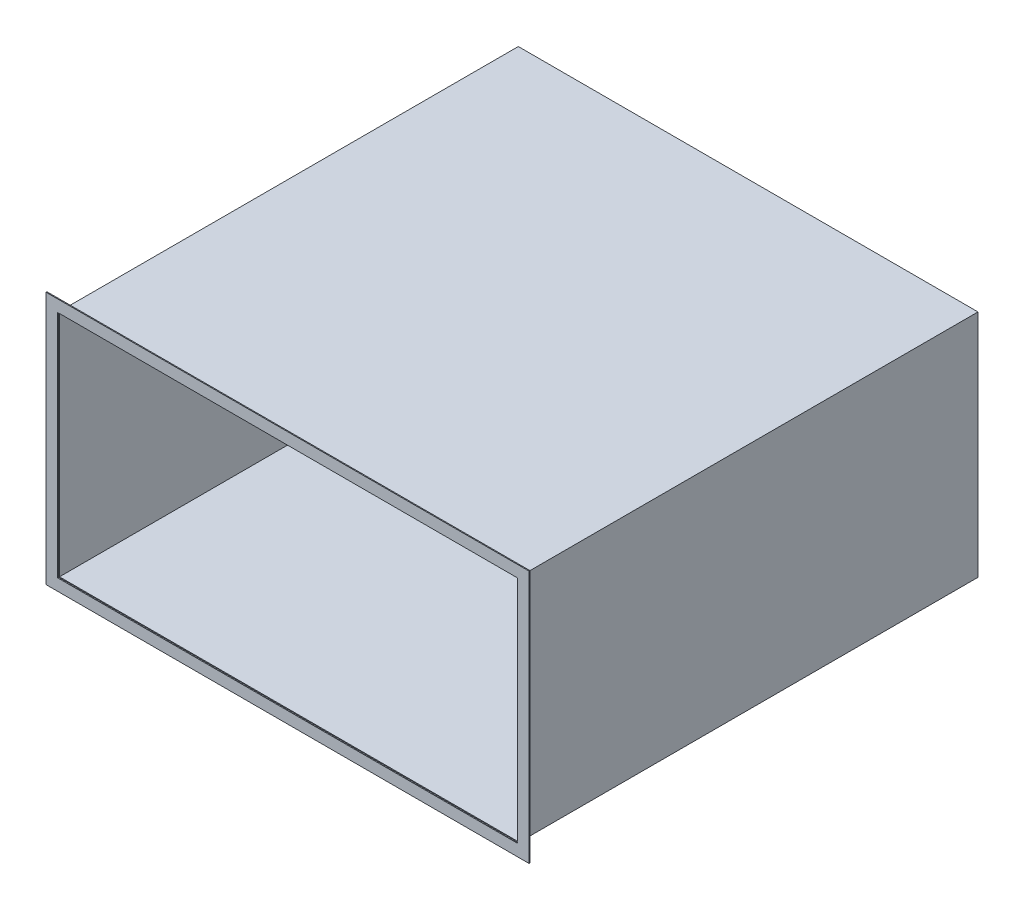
ISO-10303-21;
HEADER;
FILE_DESCRIPTION(('STEP AP214'),'2;1');
FILE_NAME('part.step','',(''),(''),'','','');
FILE_SCHEMA(('AUTOMOTIVE_DESIGN { 1 0 10303 214 1 1 1 1 }'));
ENDSEC;
DATA;
#1=APPLICATION_CONTEXT('core data for automotive mechanical design processes');
#2=APPLICATION_PROTOCOL_DEFINITION('international standard','automotive_design',2000,#1);
#3=PRODUCT_CONTEXT('',#1,'mechanical');
#4=PRODUCT('Part','Part','',(#3));
#5=PRODUCT_RELATED_PRODUCT_CATEGORY('part','',(#4));
#6=PRODUCT_DEFINITION_FORMATION('','',#4);
#7=PRODUCT_DEFINITION_CONTEXT('part definition',#1,'design');
#8=PRODUCT_DEFINITION('design','',#6,#7);
#9=PRODUCT_DEFINITION_SHAPE('','',#8);
#10=(LENGTH_UNIT() NAMED_UNIT(*) SI_UNIT(.MILLI.,.METRE.));
#11=(NAMED_UNIT(*) PLANE_ANGLE_UNIT() SI_UNIT($,.RADIAN.));
#12=(NAMED_UNIT(*) SI_UNIT($,.STERADIAN.) SOLID_ANGLE_UNIT());
#13=UNCERTAINTY_MEASURE_WITH_UNIT(LENGTH_MEASURE(1.E-05),#10,'distance_accuracy_value','');
#14=(GEOMETRIC_REPRESENTATION_CONTEXT(3) GLOBAL_UNCERTAINTY_ASSIGNED_CONTEXT((#13)) GLOBAL_UNIT_ASSIGNED_CONTEXT((#10,
#11,#12)) REPRESENTATION_CONTEXT('',''));
#15=CARTESIAN_POINT('',(0.,0.,0.));
#16=DIRECTION('',(0.,0.,1.));
#17=DIRECTION('',(1.,0.,0.));
#18=AXIS2_PLACEMENT_3D('',#15,#16,#17);
#19=CARTESIAN_POINT('',(0.,0.,1002.));
#20=DIRECTION('',(0.,0.,1.));
#21=DIRECTION('',(1.,0.,0.));
#22=AXIS2_PLACEMENT_3D('',#19,#20,#21);
#23=PLANE('',#22);
#24=DIRECTION('',(1.,0.,0.));
#25=VECTOR('',#24,1.);
#26=CARTESIAN_POINT('',(-525.4,-275.4,1002.));
#27=LINE('',#26,#25);
#28=CARTESIAN_POINT('',(-525.4,-275.4,1002.));
#29=VERTEX_POINT('',#28);
#30=CARTESIAN_POINT('',(525.4,-275.4,1002.));
#31=VERTEX_POINT('',#30);
#32=EDGE_CURVE('E167',#29,#31,#27,.T.);
#33=ORIENTED_EDGE('',*,*,#32,.T.);
#34=DIRECTION('',(0.,1.,0.));
#35=VECTOR('',#34,1.);
#36=CARTESIAN_POINT('',(525.4,-275.4,1002.));
#37=LINE('',#36,#35);
#38=CARTESIAN_POINT('',(525.4,275.4,1002.));
#39=VERTEX_POINT('',#38);
#40=EDGE_CURVE('E170',#31,#39,#37,.T.);
#41=ORIENTED_EDGE('',*,*,#40,.T.);
#42=DIRECTION('',(-1.,0.,0.));
#43=VECTOR('',#42,1.);
#44=CARTESIAN_POINT('',(525.4,275.4,1002.));
#45=LINE('',#44,#43);
#46=CARTESIAN_POINT('',(-525.4,275.4,1002.));
#47=VERTEX_POINT('',#46);
#48=EDGE_CURVE('E173',#39,#47,#45,.T.);
#49=ORIENTED_EDGE('',*,*,#48,.T.);
#50=DIRECTION('',(0.,-1.,0.));
#51=VECTOR('',#50,1.);
#52=CARTESIAN_POINT('',(-525.4,275.4,1002.));
#53=LINE('',#52,#51);
#54=EDGE_CURVE('E175',#47,#29,#53,.T.);
#55=ORIENTED_EDGE('',*,*,#54,.T.);
#56=EDGE_LOOP('',(#33,#41,#49,#55));
#57=FACE_BOUND('',#56,.T.);
#58=DIRECTION('',(0.,1.,0.));
#59=VECTOR('',#58,1.);
#60=CARTESIAN_POINT('',(500.,-250.,1002.));
#61=LINE('',#60,#59);
#62=CARTESIAN_POINT('',(500.,-250.,1002.));
#63=VERTEX_POINT('',#62);
#64=CARTESIAN_POINT('',(500.,250.,1002.));
#65=VERTEX_POINT('',#64);
#66=EDGE_CURVE('E139',#63,#65,#61,.T.);
#67=ORIENTED_EDGE('',*,*,#66,.F.);
#68=DIRECTION('',(1.,0.,0.));
#69=VECTOR('',#68,1.);
#70=CARTESIAN_POINT('',(-500.,-250.,1002.));
#71=LINE('',#70,#69);
#72=CARTESIAN_POINT('',(-500.,-250.,1002.));
#73=VERTEX_POINT('',#72);
#74=EDGE_CURVE('E131',#73,#63,#71,.T.);
#75=ORIENTED_EDGE('',*,*,#74,.F.);
#76=DIRECTION('',(0.,-1.,0.));
#77=VECTOR('',#76,1.);
#78=CARTESIAN_POINT('',(-500.,250.,1002.));
#79=LINE('',#78,#77);
#80=CARTESIAN_POINT('',(-500.,250.,1002.));
#81=VERTEX_POINT('',#80);
#82=EDGE_CURVE('E153',#81,#73,#79,.T.);
#83=ORIENTED_EDGE('',*,*,#82,.F.);
#84=DIRECTION('',(-1.,0.,0.));
#85=VECTOR('',#84,1.);
#86=CARTESIAN_POINT('',(500.,250.,1002.));
#87=LINE('',#86,#85);
#88=EDGE_CURVE('E151',#65,#81,#87,.T.);
#89=ORIENTED_EDGE('',*,*,#88,.F.);
#90=EDGE_LOOP('',(#67,#75,#83,#89));
#91=FACE_BOUND('',#90,.T.);
#92=ADVANCED_FACE('F66',(#57,#91),#23,.T.);
#93=CARTESIAN_POINT('',(0.,0.,1000.));
#94=DIRECTION('',(0.,0.,1.));
#95=DIRECTION('',(1.,0.,0.));
#96=AXIS2_PLACEMENT_3D('',#93,#94,#95);
#97=PLANE('',#96);
#98=DIRECTION('',(1.,0.,0.));
#99=VECTOR('',#98,1.);
#100=CARTESIAN_POINT('',(-525.4,-275.4,1000.));
#101=LINE('',#100,#99);
#102=CARTESIAN_POINT('',(-525.4,-275.4,1000.));
#103=VERTEX_POINT('',#102);
#104=CARTESIAN_POINT('',(525.4,-275.4,1000.));
#105=VERTEX_POINT('',#104);
#106=EDGE_CURVE('E147',#103,#105,#101,.T.);
#107=ORIENTED_EDGE('',*,*,#106,.F.);
#108=DIRECTION('',(0.,-1.,0.));
#109=VECTOR('',#108,1.);
#110=CARTESIAN_POINT('',(-525.4,275.4,1000.));
#111=LINE('',#110,#109);
#112=CARTESIAN_POINT('',(-525.4,275.4,1000.));
#113=VERTEX_POINT('',#112);
#114=EDGE_CURVE('E171',#113,#103,#111,.T.);
#115=ORIENTED_EDGE('',*,*,#114,.F.);
#116=DIRECTION('',(-1.,0.,0.));
#117=VECTOR('',#116,1.);
#118=CARTESIAN_POINT('',(525.4,275.4,1000.));
#119=LINE('',#118,#117);
#120=CARTESIAN_POINT('',(525.4,275.4,1000.));
#121=VERTEX_POINT('',#120);
#122=EDGE_CURVE('E182',#121,#113,#119,.T.);
#123=ORIENTED_EDGE('',*,*,#122,.F.);
#124=DIRECTION('',(0.,1.,0.));
#125=VECTOR('',#124,1.);
#126=CARTESIAN_POINT('',(525.4,-275.4,1000.));
#127=LINE('',#126,#125);
#128=EDGE_CURVE('E180',#105,#121,#127,.T.);
#129=ORIENTED_EDGE('',*,*,#128,.F.);
#130=EDGE_LOOP('',(#107,#115,#123,#129));
#131=FACE_BOUND('',#130,.T.);
#132=DIRECTION('',(1.,0.,0.));
#133=VECTOR('',#132,1.);
#134=CARTESIAN_POINT('',(-500.,-250.,1000.));
#135=LINE('',#134,#133);
#136=CARTESIAN_POINT('',(-500.,-250.,1000.));
#137=VERTEX_POINT('',#136);
#138=CARTESIAN_POINT('',(500.,-250.,1000.));
#139=VERTEX_POINT('',#138);
#140=EDGE_CURVE('E89',#137,#139,#135,.T.);
#141=ORIENTED_EDGE('',*,*,#140,.T.);
#142=DIRECTION('',(0.,1.,0.));
#143=VECTOR('',#142,1.);
#144=CARTESIAN_POINT('',(500.,-250.,1000.));
#145=LINE('',#144,#143);
#146=CARTESIAN_POINT('',(500.,250.,1000.));
#147=VERTEX_POINT('',#146);
#148=EDGE_CURVE('E146',#139,#147,#145,.T.);
#149=ORIENTED_EDGE('',*,*,#148,.T.);
#150=DIRECTION('',(-1.,0.,0.));
#151=VECTOR('',#150,1.);
#152=CARTESIAN_POINT('',(500.,250.,1000.));
#153=LINE('',#152,#151);
#154=CARTESIAN_POINT('',(-500.,250.,1000.));
#155=VERTEX_POINT('',#154);
#156=EDGE_CURVE('E159',#147,#155,#153,.T.);
#157=ORIENTED_EDGE('',*,*,#156,.T.);
#158=DIRECTION('',(0.,-1.,0.));
#159=VECTOR('',#158,1.);
#160=CARTESIAN_POINT('',(-500.,250.,1000.));
#161=LINE('',#160,#159);
#162=EDGE_CURVE('E140',#155,#137,#161,.T.);
#163=ORIENTED_EDGE('',*,*,#162,.T.);
#164=EDGE_LOOP('',(#141,#149,#157,#163));
#165=FACE_BOUND('',#164,.T.);
#166=ADVANCED_FACE('F200',(#131,#165),#97,.F.);
#167=CARTESIAN_POINT('',(-525.4,-275.4,1002.));
#168=DIRECTION('',(0.,1.,0.));
#169=DIRECTION('',(0.,0.,1.));
#170=AXIS2_PLACEMENT_3D('',#167,#168,#169);
#171=PLANE('',#170);
#172=ORIENTED_EDGE('',*,*,#106,.T.);
#173=DIRECTION('',(0.,0.,-1.));
#174=VECTOR('',#173,1.);
#175=CARTESIAN_POINT('',(525.4,-275.4,1002.));
#176=LINE('',#175,#174);
#177=EDGE_CURVE('E13',#31,#105,#176,.T.);
#178=ORIENTED_EDGE('',*,*,#177,.F.);
#179=ORIENTED_EDGE('',*,*,#32,.F.);
#180=DIRECTION('',(0.,0.,-1.));
#181=VECTOR('',#180,1.);
#182=CARTESIAN_POINT('',(-525.4,-275.4,1002.));
#183=LINE('',#182,#181);
#184=EDGE_CURVE('E177',#29,#103,#183,.T.);
#185=ORIENTED_EDGE('',*,*,#184,.T.);
#186=EDGE_LOOP('',(#172,#178,#179,#185));
#187=FACE_BOUND('',#186,.T.);
#188=ADVANCED_FACE('F68',(#187),#171,.F.);
#189=CARTESIAN_POINT('',(525.4,-275.4,1002.));
#190=DIRECTION('',(-1.,0.,0.));
#191=DIRECTION('',(0.,-1.,0.));
#192=AXIS2_PLACEMENT_3D('',#189,#190,#191);
#193=PLANE('',#192);
#194=ORIENTED_EDGE('',*,*,#128,.T.);
#195=DIRECTION('',(0.,0.,-1.));
#196=VECTOR('',#195,1.);
#197=CARTESIAN_POINT('',(525.4,275.4,1002.));
#198=LINE('',#197,#196);
#199=EDGE_CURVE('E74',#39,#121,#198,.T.);
#200=ORIENTED_EDGE('',*,*,#199,.F.);
#201=ORIENTED_EDGE('',*,*,#40,.F.);
#202=ORIENTED_EDGE('',*,*,#177,.T.);
#203=EDGE_LOOP('',(#194,#200,#201,#202));
#204=FACE_BOUND('',#203,.T.);
#205=ADVANCED_FACE('F210',(#204),#193,.F.);
#206=CARTESIAN_POINT('',(525.4,275.4,1002.));
#207=DIRECTION('',(0.,-1.,0.));
#208=DIRECTION('',(0.,0.,-1.));
#209=AXIS2_PLACEMENT_3D('',#206,#207,#208);
#210=PLANE('',#209);
#211=ORIENTED_EDGE('',*,*,#122,.T.);
#212=DIRECTION('',(0.,0.,-1.));
#213=VECTOR('',#212,1.);
#214=CARTESIAN_POINT('',(-525.4,275.4,1002.));
#215=LINE('',#214,#213);
#216=EDGE_CURVE('E187',#47,#113,#215,.T.);
#217=ORIENTED_EDGE('',*,*,#216,.F.);
#218=ORIENTED_EDGE('',*,*,#48,.F.);
#219=ORIENTED_EDGE('',*,*,#199,.T.);
#220=EDGE_LOOP('',(#211,#217,#218,#219));
#221=FACE_BOUND('',#220,.T.);
#222=ADVANCED_FACE('F194',(#221),#210,.F.);
#223=CARTESIAN_POINT('',(-525.4,275.4,1002.));
#224=DIRECTION('',(1.,0.,0.));
#225=DIRECTION('',(0.,1.,0.));
#226=AXIS2_PLACEMENT_3D('',#223,#224,#225);
#227=PLANE('',#226);
#228=ORIENTED_EDGE('',*,*,#114,.T.);
#229=ORIENTED_EDGE('',*,*,#184,.F.);
#230=ORIENTED_EDGE('',*,*,#54,.F.);
#231=ORIENTED_EDGE('',*,*,#216,.T.);
#232=EDGE_LOOP('',(#228,#229,#230,#231));
#233=FACE_BOUND('',#232,.T.);
#234=ADVANCED_FACE('F204',(#233),#227,.F.);
#235=CARTESIAN_POINT('',(-500.,-250.,1002.));
#236=DIRECTION('',(0.,1.,0.));
#237=DIRECTION('',(0.,0.,1.));
#238=AXIS2_PLACEMENT_3D('',#235,#236,#237);
#239=PLANE('',#238);
#240=ORIENTED_EDGE('',*,*,#140,.F.);
#241=DIRECTION('',(0.,0.,-1.));
#242=VECTOR('',#241,1.);
#243=CARTESIAN_POINT('',(-500.,-250.,1002.));
#244=LINE('',#243,#242);
#245=EDGE_CURVE('E135',#73,#137,#244,.T.);
#246=ORIENTED_EDGE('',*,*,#245,.F.);
#247=ORIENTED_EDGE('',*,*,#74,.T.);
#248=DIRECTION('',(0.,0.,-1.));
#249=VECTOR('',#248,1.);
#250=CARTESIAN_POINT('',(500.,-250.,1002.));
#251=LINE('',#250,#249);
#252=EDGE_CURVE('E134',#63,#139,#251,.T.);
#253=ORIENTED_EDGE('',*,*,#252,.T.);
#254=EDGE_LOOP('',(#240,#246,#247,#253));
#255=FACE_BOUND('',#254,.T.);
#256=ADVANCED_FACE('F133',(#255),#239,.T.);
#257=CARTESIAN_POINT('',(500.,-250.,1002.));
#258=DIRECTION('',(-1.,0.,0.));
#259=DIRECTION('',(0.,-1.,0.));
#260=AXIS2_PLACEMENT_3D('',#257,#258,#259);
#261=PLANE('',#260);
#262=ORIENTED_EDGE('',*,*,#148,.F.);
#263=ORIENTED_EDGE('',*,*,#252,.F.);
#264=ORIENTED_EDGE('',*,*,#66,.T.);
#265=DIRECTION('',(0.,0.,-1.));
#266=VECTOR('',#265,1.);
#267=CARTESIAN_POINT('',(500.,250.,1002.));
#268=LINE('',#267,#266);
#269=EDGE_CURVE('E148',#65,#147,#268,.T.);
#270=ORIENTED_EDGE('',*,*,#269,.T.);
#271=EDGE_LOOP('',(#262,#263,#264,#270));
#272=FACE_BOUND('',#271,.T.);
#273=ADVANCED_FACE('F143',(#272),#261,.T.);
#274=CARTESIAN_POINT('',(500.,250.,1002.));
#275=DIRECTION('',(0.,-1.,0.));
#276=DIRECTION('',(0.,0.,-1.));
#277=AXIS2_PLACEMENT_3D('',#274,#275,#276);
#278=PLANE('',#277);
#279=ORIENTED_EDGE('',*,*,#156,.F.);
#280=ORIENTED_EDGE('',*,*,#269,.F.);
#281=ORIENTED_EDGE('',*,*,#88,.T.);
#282=DIRECTION('',(0.,0.,-1.));
#283=VECTOR('',#282,1.);
#284=CARTESIAN_POINT('',(-500.,250.,1002.));
#285=LINE('',#284,#283);
#286=EDGE_CURVE('E81',#81,#155,#285,.T.);
#287=ORIENTED_EDGE('',*,*,#286,.T.);
#288=EDGE_LOOP('',(#279,#280,#281,#287));
#289=FACE_BOUND('',#288,.T.);
#290=ADVANCED_FACE('F233',(#289),#278,.T.);
#291=CARTESIAN_POINT('',(-500.,250.,1002.));
#292=DIRECTION('',(1.,0.,0.));
#293=DIRECTION('',(0.,1.,0.));
#294=AXIS2_PLACEMENT_3D('',#291,#292,#293);
#295=PLANE('',#294);
#296=ORIENTED_EDGE('',*,*,#162,.F.);
#297=ORIENTED_EDGE('',*,*,#286,.F.);
#298=ORIENTED_EDGE('',*,*,#82,.T.);
#299=ORIENTED_EDGE('',*,*,#245,.T.);
#300=EDGE_LOOP('',(#296,#297,#298,#299));
#301=FACE_BOUND('',#300,.T.);
#302=ADVANCED_FACE('F237',(#301),#295,.T.);
#303=CLOSED_SHELL('',(#92,#166,#188,#205,#222,#234,#256,#273,#290,#302));
#304=MANIFOLD_SOLID_BREP('B2',#303);
#305=CARTESIAN_POINT('',(0.,0.,1000.));
#306=DIRECTION('',(0.,0.,1.));
#307=DIRECTION('',(1.,0.,0.));
#308=AXIS2_PLACEMENT_3D('',#305,#306,#307);
#309=PLANE('',#308);
#310=DIRECTION('',(0.,1.,0.));
#311=VECTOR('',#310,1.);
#312=CARTESIAN_POINT('',(500.,250.,1000.));
#313=LINE('',#312,#311);
#314=CARTESIAN_POINT('',(500.,-250.,1000.));
#315=VERTEX_POINT('',#314);
#316=CARTESIAN_POINT('',(500.,250.,1000.));
#317=VERTEX_POINT('',#316);
#318=EDGE_CURVE('E396',#315,#317,#313,.T.);
#319=ORIENTED_EDGE('',*,*,#318,.T.);
#320=DIRECTION('',(-1.,0.,0.));
#321=VECTOR('',#320,1.);
#322=CARTESIAN_POINT('',(-500.,250.,1000.));
#323=LINE('',#322,#321);
#324=CARTESIAN_POINT('',(-500.,250.,1000.));
#325=VERTEX_POINT('',#324);
#326=EDGE_CURVE('E399',#317,#325,#323,.T.);
#327=ORIENTED_EDGE('',*,*,#326,.T.);
#328=DIRECTION('',(0.,-1.,0.));
#329=VECTOR('',#328,1.);
#330=CARTESIAN_POINT('',(-500.,250.,1000.));
#331=LINE('',#330,#329);
#332=CARTESIAN_POINT('',(-500.,-250.,1000.));
#333=VERTEX_POINT('',#332);
#334=EDGE_CURVE('E402',#325,#333,#331,.T.);
#335=ORIENTED_EDGE('',*,*,#334,.T.);
#336=DIRECTION('',(1.,0.,0.));
#337=VECTOR('',#336,1.);
#338=CARTESIAN_POINT('',(-500.,-250.,1000.));
#339=LINE('',#338,#337);
#340=EDGE_CURVE('E404',#333,#315,#339,.T.);
#341=ORIENTED_EDGE('',*,*,#340,.T.);
#342=EDGE_LOOP('',(#319,#327,#335,#341));
#343=FACE_BOUND('',#342,.T.);
#344=DIRECTION('',(-1.,0.,0.));
#345=VECTOR('',#344,1.);
#346=CARTESIAN_POINT('',(-500.,248.,1000.));
#347=LINE('',#346,#345);
#348=CARTESIAN_POINT('',(498.,248.,1000.));
#349=VERTEX_POINT('',#348);
#350=CARTESIAN_POINT('',(-498.,248.,1000.));
#351=VERTEX_POINT('',#350);
#352=EDGE_CURVE('E368',#349,#351,#347,.T.);
#353=ORIENTED_EDGE('',*,*,#352,.F.);
#354=DIRECTION('',(0.,1.,0.));
#355=VECTOR('',#354,1.);
#356=CARTESIAN_POINT('',(498.,250.,1000.));
#357=LINE('',#356,#355);
#358=CARTESIAN_POINT('',(498.,-248.,1000.));
#359=VERTEX_POINT('',#358);
#360=EDGE_CURVE('E360',#359,#349,#357,.T.);
#361=ORIENTED_EDGE('',*,*,#360,.F.);
#362=DIRECTION('',(1.,0.,0.));
#363=VECTOR('',#362,1.);
#364=CARTESIAN_POINT('',(-500.,-248.,1000.));
#365=LINE('',#364,#363);
#366=CARTESIAN_POINT('',(-498.,-248.,1000.));
#367=VERTEX_POINT('',#366);
#368=EDGE_CURVE('E382',#367,#359,#365,.T.);
#369=ORIENTED_EDGE('',*,*,#368,.F.);
#370=DIRECTION('',(0.,-1.,0.));
#371=VECTOR('',#370,1.);
#372=CARTESIAN_POINT('',(-498.,250.,1000.));
#373=LINE('',#372,#371);
#374=EDGE_CURVE('E380',#351,#367,#373,.T.);
#375=ORIENTED_EDGE('',*,*,#374,.F.);
#376=EDGE_LOOP('',(#353,#361,#369,#375));
#377=FACE_BOUND('',#376,.T.);
#378=ADVANCED_FACE('F295',(#343,#377),#309,.T.);
#379=CARTESIAN_POINT('',(0.,0.,0.));
#380=DIRECTION('',(0.,0.,1.));
#381=DIRECTION('',(1.,0.,0.));
#382=AXIS2_PLACEMENT_3D('',#379,#380,#381);
#383=PLANE('',#382);
#384=DIRECTION('',(0.,1.,0.));
#385=VECTOR('',#384,1.);
#386=CARTESIAN_POINT('',(500.,250.,0.));
#387=LINE('',#386,#385);
#388=CARTESIAN_POINT('',(500.,-250.,0.));
#389=VERTEX_POINT('',#388);
#390=CARTESIAN_POINT('',(500.,250.,0.));
#391=VERTEX_POINT('',#390);
#392=EDGE_CURVE('E376',#389,#391,#387,.T.);
#393=ORIENTED_EDGE('',*,*,#392,.F.);
#394=DIRECTION('',(1.,0.,0.));
#395=VECTOR('',#394,1.);
#396=CARTESIAN_POINT('',(-500.,-250.,0.));
#397=LINE('',#396,#395);
#398=CARTESIAN_POINT('',(-500.,-250.,0.));
#399=VERTEX_POINT('',#398);
#400=EDGE_CURVE('E400',#399,#389,#397,.T.);
#401=ORIENTED_EDGE('',*,*,#400,.F.);
#402=DIRECTION('',(0.,-1.,0.));
#403=VECTOR('',#402,1.);
#404=CARTESIAN_POINT('',(-500.,250.,0.));
#405=LINE('',#404,#403);
#406=CARTESIAN_POINT('',(-500.,250.,0.));
#407=VERTEX_POINT('',#406);
#408=EDGE_CURVE('E411',#407,#399,#405,.T.);
#409=ORIENTED_EDGE('',*,*,#408,.F.);
#410=DIRECTION('',(-1.,0.,0.));
#411=VECTOR('',#410,1.);
#412=CARTESIAN_POINT('',(-500.,250.,0.));
#413=LINE('',#412,#411);
#414=EDGE_CURVE('E409',#391,#407,#413,.T.);
#415=ORIENTED_EDGE('',*,*,#414,.F.);
#416=EDGE_LOOP('',(#393,#401,#409,#415));
#417=FACE_BOUND('',#416,.T.);
#418=DIRECTION('',(0.,1.,0.));
#419=VECTOR('',#418,1.);
#420=CARTESIAN_POINT('',(498.,250.,0.));
#421=LINE('',#420,#419);
#422=CARTESIAN_POINT('',(498.,-248.,0.));
#423=VERTEX_POINT('',#422);
#424=CARTESIAN_POINT('',(498.,248.,0.));
#425=VERTEX_POINT('',#424);
#426=EDGE_CURVE('E318',#423,#425,#421,.T.);
#427=ORIENTED_EDGE('',*,*,#426,.T.);
#428=DIRECTION('',(-1.,0.,0.));
#429=VECTOR('',#428,1.);
#430=CARTESIAN_POINT('',(-500.,248.,0.));
#431=LINE('',#430,#429);
#432=CARTESIAN_POINT('',(-498.,248.,0.));
#433=VERTEX_POINT('',#432);
#434=EDGE_CURVE('E375',#425,#433,#431,.T.);
#435=ORIENTED_EDGE('',*,*,#434,.T.);
#436=DIRECTION('',(0.,-1.,0.));
#437=VECTOR('',#436,1.);
#438=CARTESIAN_POINT('',(-498.,250.,0.));
#439=LINE('',#438,#437);
#440=CARTESIAN_POINT('',(-498.,-248.,0.));
#441=VERTEX_POINT('',#440);
#442=EDGE_CURVE('E388',#433,#441,#439,.T.);
#443=ORIENTED_EDGE('',*,*,#442,.T.);
#444=DIRECTION('',(1.,0.,0.));
#445=VECTOR('',#444,1.);
#446=CARTESIAN_POINT('',(-500.,-248.,0.));
#447=LINE('',#446,#445);
#448=EDGE_CURVE('E369',#441,#423,#447,.T.);
#449=ORIENTED_EDGE('',*,*,#448,.T.);
#450=EDGE_LOOP('',(#427,#435,#443,#449));
#451=FACE_BOUND('',#450,.T.);
#452=ADVANCED_FACE('F429',(#417,#451),#383,.F.);
#453=CARTESIAN_POINT('',(500.,250.,1000.));
#454=DIRECTION('',(-1.,0.,0.));
#455=DIRECTION('',(0.,-1.,0.));
#456=AXIS2_PLACEMENT_3D('',#453,#454,#455);
#457=PLANE('',#456);
#458=ORIENTED_EDGE('',*,*,#392,.T.);
#459=DIRECTION('',(0.,0.,-1.));
#460=VECTOR('',#459,1.);
#461=CARTESIAN_POINT('',(500.,250.,1000.));
#462=LINE('',#461,#460);
#463=EDGE_CURVE('E64',#317,#391,#462,.T.);
#464=ORIENTED_EDGE('',*,*,#463,.F.);
#465=ORIENTED_EDGE('',*,*,#318,.F.);
#466=DIRECTION('',(0.,0.,-1.));
#467=VECTOR('',#466,1.);
#468=CARTESIAN_POINT('',(500.,-250.,1000.));
#469=LINE('',#468,#467);
#470=EDGE_CURVE('E406',#315,#389,#469,.T.);
#471=ORIENTED_EDGE('',*,*,#470,.T.);
#472=EDGE_LOOP('',(#458,#464,#465,#471));
#473=FACE_BOUND('',#472,.T.);
#474=ADVANCED_FACE('F297',(#473),#457,.F.);
#475=CARTESIAN_POINT('',(-500.,250.,1000.));
#476=DIRECTION('',(0.,-1.,0.));
#477=DIRECTION('',(0.,0.,-1.));
#478=AXIS2_PLACEMENT_3D('',#475,#476,#477);
#479=PLANE('',#478);
#480=ORIENTED_EDGE('',*,*,#414,.T.);
#481=DIRECTION('',(0.,0.,-1.));
#482=VECTOR('',#481,1.);
#483=CARTESIAN_POINT('',(-500.,250.,1000.));
#484=LINE('',#483,#482);
#485=EDGE_CURVE('E303',#325,#407,#484,.T.);
#486=ORIENTED_EDGE('',*,*,#485,.F.);
#487=ORIENTED_EDGE('',*,*,#326,.F.);
#488=ORIENTED_EDGE('',*,*,#463,.T.);
#489=EDGE_LOOP('',(#480,#486,#487,#488));
#490=FACE_BOUND('',#489,.T.);
#491=ADVANCED_FACE('F439',(#490),#479,.F.);
#492=CARTESIAN_POINT('',(-500.,250.,1000.));
#493=DIRECTION('',(1.,0.,0.));
#494=DIRECTION('',(0.,1.,0.));
#495=AXIS2_PLACEMENT_3D('',#492,#493,#494);
#496=PLANE('',#495);
#497=ORIENTED_EDGE('',*,*,#408,.T.);
#498=DIRECTION('',(0.,0.,-1.));
#499=VECTOR('',#498,1.);
#500=CARTESIAN_POINT('',(-500.,-250.,1000.));
#501=LINE('',#500,#499);
#502=EDGE_CURVE('E416',#333,#399,#501,.T.);
#503=ORIENTED_EDGE('',*,*,#502,.F.);
#504=ORIENTED_EDGE('',*,*,#334,.F.);
#505=ORIENTED_EDGE('',*,*,#485,.T.);
#506=EDGE_LOOP('',(#497,#503,#504,#505));
#507=FACE_BOUND('',#506,.T.);
#508=ADVANCED_FACE('F423',(#507),#496,.F.);
#509=CARTESIAN_POINT('',(-500.,-250.,1000.));
#510=DIRECTION('',(0.,1.,0.));
#511=DIRECTION('',(0.,0.,1.));
#512=AXIS2_PLACEMENT_3D('',#509,#510,#511);
#513=PLANE('',#512);
#514=ORIENTED_EDGE('',*,*,#400,.T.);
#515=ORIENTED_EDGE('',*,*,#470,.F.);
#516=ORIENTED_EDGE('',*,*,#340,.F.);
#517=ORIENTED_EDGE('',*,*,#502,.T.);
#518=EDGE_LOOP('',(#514,#515,#516,#517));
#519=FACE_BOUND('',#518,.T.);
#520=ADVANCED_FACE('F433',(#519),#513,.F.);
#521=CARTESIAN_POINT('',(498.,250.,1000.));
#522=DIRECTION('',(-1.,0.,0.));
#523=DIRECTION('',(0.,-1.,0.));
#524=AXIS2_PLACEMENT_3D('',#521,#522,#523);
#525=PLANE('',#524);
#526=ORIENTED_EDGE('',*,*,#426,.F.);
#527=DIRECTION('',(0.,0.,-1.));
#528=VECTOR('',#527,1.);
#529=CARTESIAN_POINT('',(498.,-248.,1000.));
#530=LINE('',#529,#528);
#531=EDGE_CURVE('E364',#359,#423,#530,.T.);
#532=ORIENTED_EDGE('',*,*,#531,.F.);
#533=ORIENTED_EDGE('',*,*,#360,.T.);
#534=DIRECTION('',(0.,0.,-1.));
#535=VECTOR('',#534,1.);
#536=CARTESIAN_POINT('',(498.,248.,1000.));
#537=LINE('',#536,#535);
#538=EDGE_CURVE('E363',#349,#425,#537,.T.);
#539=ORIENTED_EDGE('',*,*,#538,.T.);
#540=EDGE_LOOP('',(#526,#532,#533,#539));
#541=FACE_BOUND('',#540,.T.);
#542=ADVANCED_FACE('F362',(#541),#525,.T.);
#543=CARTESIAN_POINT('',(-500.,248.,1000.));
#544=DIRECTION('',(0.,-1.,0.));
#545=DIRECTION('',(0.,0.,-1.));
#546=AXIS2_PLACEMENT_3D('',#543,#544,#545);
#547=PLANE('',#546);
#548=ORIENTED_EDGE('',*,*,#434,.F.);
#549=ORIENTED_EDGE('',*,*,#538,.F.);
#550=ORIENTED_EDGE('',*,*,#352,.T.);
#551=DIRECTION('',(0.,0.,-1.));
#552=VECTOR('',#551,1.);
#553=CARTESIAN_POINT('',(-498.,248.,1000.));
#554=LINE('',#553,#552);
#555=EDGE_CURVE('E377',#351,#433,#554,.T.);
#556=ORIENTED_EDGE('',*,*,#555,.T.);
#557=EDGE_LOOP('',(#548,#549,#550,#556));
#558=FACE_BOUND('',#557,.T.);
#559=ADVANCED_FACE('F372',(#558),#547,.T.);
#560=CARTESIAN_POINT('',(-498.,250.,1000.));
#561=DIRECTION('',(1.,0.,0.));
#562=DIRECTION('',(0.,1.,0.));
#563=AXIS2_PLACEMENT_3D('',#560,#561,#562);
#564=PLANE('',#563);
#565=ORIENTED_EDGE('',*,*,#442,.F.);
#566=ORIENTED_EDGE('',*,*,#555,.F.);
#567=ORIENTED_EDGE('',*,*,#374,.T.);
#568=DIRECTION('',(0.,0.,-1.));
#569=VECTOR('',#568,1.);
#570=CARTESIAN_POINT('',(-498.,-248.,1000.));
#571=LINE('',#570,#569);
#572=EDGE_CURVE('E310',#367,#441,#571,.T.);
#573=ORIENTED_EDGE('',*,*,#572,.T.);
#574=EDGE_LOOP('',(#565,#566,#567,#573));
#575=FACE_BOUND('',#574,.T.);
#576=ADVANCED_FACE('F462',(#575),#564,.T.);
#577=CARTESIAN_POINT('',(-500.,-248.,1000.));
#578=DIRECTION('',(0.,1.,0.));
#579=DIRECTION('',(0.,0.,1.));
#580=AXIS2_PLACEMENT_3D('',#577,#578,#579);
#581=PLANE('',#580);
#582=ORIENTED_EDGE('',*,*,#448,.F.);
#583=ORIENTED_EDGE('',*,*,#572,.F.);
#584=ORIENTED_EDGE('',*,*,#368,.T.);
#585=ORIENTED_EDGE('',*,*,#531,.T.);
#586=EDGE_LOOP('',(#582,#583,#584,#585));
#587=FACE_BOUND('',#586,.T.);
#588=ADVANCED_FACE('F466',(#587),#581,.T.);
#589=CLOSED_SHELL('',(#378,#452,#474,#491,#508,#520,#542,#559,#576,#588));
#590=MANIFOLD_SOLID_BREP('B7',#589);
#591=ADVANCED_BREP_SHAPE_REPRESENTATION('',(#18,#304,#590),#14);
#592=SHAPE_DEFINITION_REPRESENTATION(#9,#591);
ENDSEC;
END-ISO-10303-21;
